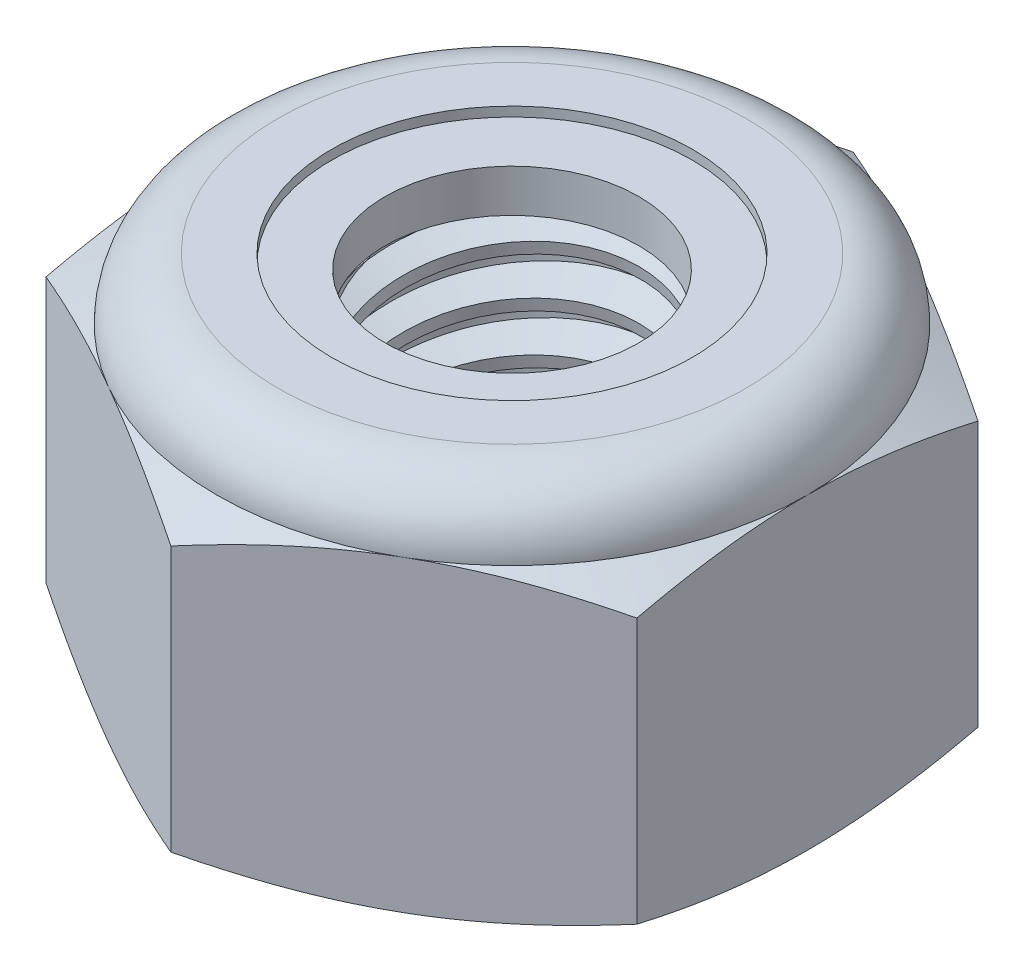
from build123d import *

# Parameters (mm, degrees)
EXTRUDE1_DEPTH      = 5.953125
SKETCH2_W           = 2.413
SKETCH2_H           = 5.953125
LPATTERN1_COUNT     = 8
LPATTERN1_PITCH     = 0.79375
LPATTERN1_COL_COUNT = 2
LPATTERN1_COL_PITCH = 0.79375


with BuildPart() as part:
    # Sketch1 → Extrude1 (new body)
    with BuildSketch(Plane(origin=(0, 0, 0), x_dir=(1, 0, 0), z_dir=(0, 1, 0))):
        Polygon((0, 5.499261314), (-4.7625, 2.749630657), (-4.7625, -2.749630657), (0, -5.499261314), (4.7625, -2.749630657), (4.7625, 2.749630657), align=None)
    extrude(amount=EXTRUDE1_DEPTH)

    # Sketch4 → Cut-Revolve2 (revolve, cut)
    with BuildSketch(Plane(origin=(0, 0, 0), x_dir=(0, 0, -1), z_dir=(1, 0, 0)), mode=Mode.PRIVATE) as cut_revolve2_sk:
        Polygon((0, 5.953125), (2.413, 5.953125), (2.045424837, 5.781721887), (2.045424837, 0.171403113), (2.413, 0), (0, 0), align=None)
    revolve(cut_revolve2_sk.sketch.rotate(Axis((0, 5.953125, 0), (0, 1, 0)), 55.135741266), axis=Axis((0, 5.953125, 0), (0, 1, 0)), mode=Mode.SUBTRACT)


with BuildPart() as body_2:
    # Sketch2 → Revolve1 (revolve)
    with BuildSketch(Plane(origin=(0, 0, 0), x_dir=(0, 0, -1), z_dir=(1, 0, 0))):
        with Locations((1.2065, 2.9765625)):
            Rectangle(SKETCH2_W, SKETCH2_H)
    revolve(axis=Axis((0, -2.413, 0), (0, 1, 0)))

    # Sketch3 → Cut-Revolve1 (revolve, cut)
    with BuildSketch(Plane(origin=(0, 0, 0), x_dir=(0, 0, -1), z_dir=(1, 0, 0)), mode=Mode.PRIVATE) as cut_revolve1_sk:
        Polygon((2.429102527, 5.855221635), (2.541820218, 5.169898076), (2.077629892, 5.344930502), (2.045424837, 5.540737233), align=None)
    cut_revolve1 = revolve(cut_revolve1_sk.sketch.rotate(Axis((0, 5.953125, 0.139697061), (0, -0.9867425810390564, -0.16229318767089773)), 180), axis=Axis((0, 5.953125, 0.139697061), (0, -0.9867425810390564, -0.16229318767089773)), mode=Mode.SUBTRACT)

    # LPattern1: Cut-Revolve1 ×8
    with Locations(*[(0, -i * LPATTERN1_PITCH, 0) for i in range(1, LPATTERN1_COUNT)]):
        add(cut_revolve1, mode=Mode.SUBTRACT)

    # LPattern1 col: Cut-Revolve1 ×2
    with Locations(*[(0, i * LPATTERN1_COL_PITCH, 0) for i in range(1, LPATTERN1_COL_COUNT)]):
        add(cut_revolve1, mode=Mode.SUBTRACT)


with BuildPart() as part_1:
    add(part.part)

    # Combine1: cut body 2
    add(body_2.part, mode=Mode.SUBTRACT)

    # Sketch5 → Cut-Revolve3 (revolve, cut)
    with BuildSketch(Plane(origin=(0, 0, 0), x_dir=(0, 0, -1), z_dir=(1, 0, 0)), mode=Mode.PRIVATE) as cut_revolve3_sk:
        with BuildLine():
            Line((0, 0), (4.7625, 0))
            Line((4.7625, 0), (5.499261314, 0.343557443))
            Line((5.499261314, 0.343557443), (5.499261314, 4.617380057))
            Line((5.499261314, 4.617380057), (4.7625, 4.9609375))
            ThreePointArc((4.7625, 4.9609375), (4.471895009, 5.662520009), (3.7703125, 5.953125))
            Line((3.7703125, 5.953125), (3.7703125, 7.223125))
            Line((3.7703125, 7.223125), (6.769261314, 7.223125))
            Line((6.769261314, 7.223125), (6.769261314, -1.27))
            Line((6.769261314, -1.27), (0, -1.27))
            Line((0, -1.27), (0, 0))
        make_face()
    revolve(cut_revolve3_sk.sketch.rotate(Axis((0, 0, 0), (0, 1, 0)), 55.135741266), axis=Axis((0, 0, 0), (0, 1, 0)), mode=Mode.SUBTRACT)

    # Sketch6 → Cut-Revolve4 (revolve, cut)
    with BuildSketch(Plane(origin=(0, 0, 0), x_dir=(0, 0, -1), z_dir=(1, 0, 0)), mode=Mode.PRIVATE) as cut_revolve4_sk:
        with BuildLine():
            Line((0, 4.9609375), (4.6101, 4.9609375))
            ThreePointArc((4.6101, 4.9609375), (4.364131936, 5.554756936), (3.7703125, 5.800725))
            Line((3.7703125, 5.800725), (2.907868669, 5.800725))
            Line((2.907868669, 5.800725), (2.907868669, 7.223125))
            Line((2.907868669, 7.223125), (0, 7.223125))
            Line((0, 7.223125), (0, 4.9609375))
        make_face()
    revolve(cut_revolve4_sk.sketch.rotate(Axis((0, 7.223125, 0), (0, 1, 0)), 55.135741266), axis=Axis((0, 7.223125, 0), (0, 1, 0)), mode=Mode.SUBTRACT)


with BuildPart() as body_2_2:
    # Sketch7 → Revolve2 (revolve)
    with BuildSketch(Plane(origin=(0, 0, 0), x_dir=(0, 0, -1), z_dir=(1, 0, 0))):
        with BuildLine():
            Line((2.045424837, 5.0371375), (4.530088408, 5.0371375))
            ThreePointArc((4.530088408, 5.0371375), (4.282601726, 5.527175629), (3.7703125, 5.724525))
            Line((3.7703125, 5.724525), (2.045424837, 5.724525))
            Line((2.045424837, 5.724525), (2.045424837, 5.0371375))
        make_face()
    revolve(axis=Axis((0, 5.0371375, 0), (0, 1, 0)))


solid = Compound([part_1.part, body_2_2.part])
